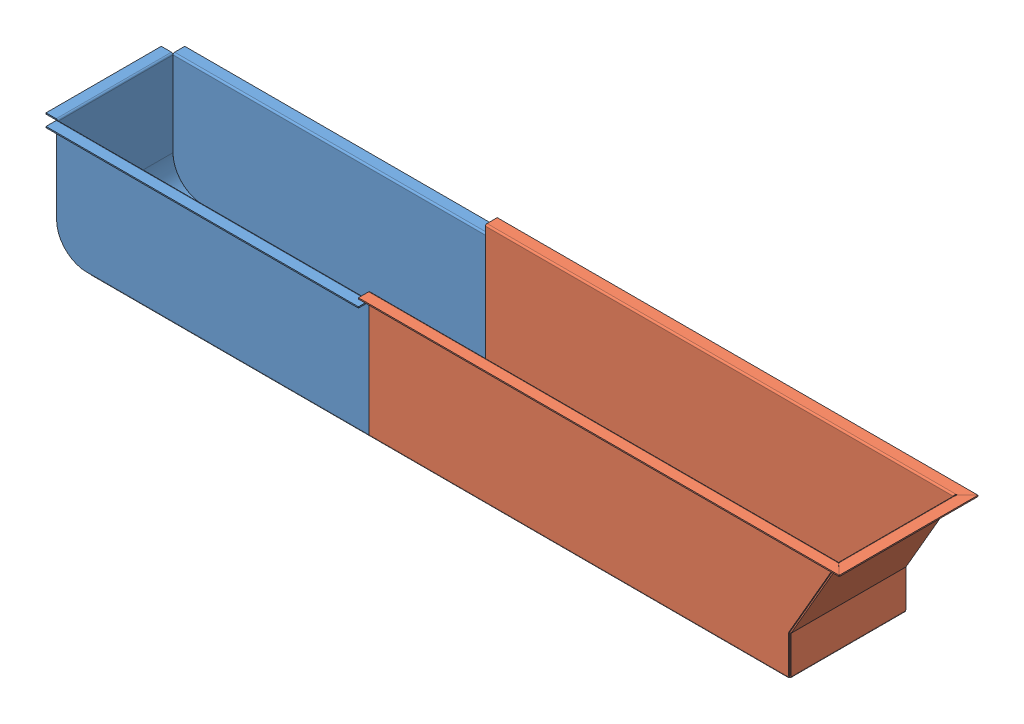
SolidWorks assembly Behaelter_kpl.SLDASM, configuration ohne_Abdeckblech (file format 4400). Lengths in mm.
Overall size (2053.54 320 354).
2 component instances, 2 part files, 0 mates.
Components (placement in the parent):
- Behaelter_1-1: Behaelter_1.SLDPRT [ohne_Abdeckblech<Wie bearbeitet>] at origin size (827 300 354)
- Behaelter_2-2: Behaelter_2.SLDPRT [Standard] at origin
